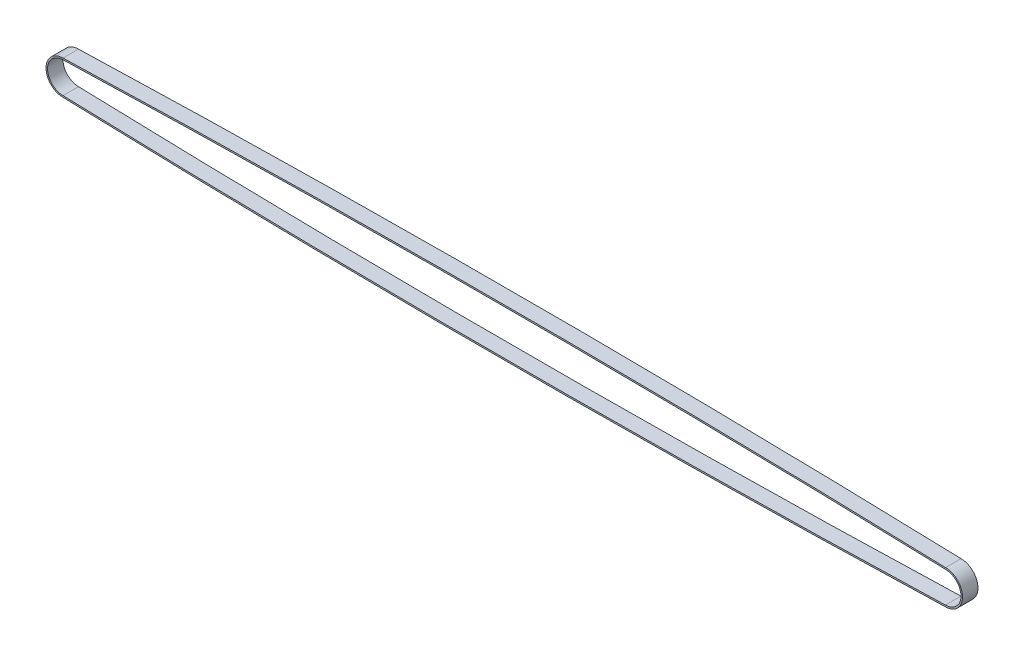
from build123d import *

# Parameters (mm, degrees)
BOSS_EXTRUDE1_DEPTH = 25.4


with BuildPart() as part:
    # Sketch1 → Boss-Extrude1 (new body)
    with BuildSketch(Plane.XY):
        with BuildLine():
            ThreePointArc((-0.041183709, 2.539969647), (723.9, 14.004624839), (1447.841183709, 2.539969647))
            ThreePointArc((1447.841183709, 2.539969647), (1475.74, -25.4), (1447.841183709, -53.339969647))
            ThreePointArc((1447.841183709, -53.339969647), (723.9, -64.804624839), (-0.041183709, -53.339969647))
            ThreePointArc((-0.041183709, -53.339969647), (-27.94, -25.4), (-0.041183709, 2.539969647))
        make_face()
        with BuildLine():
            ThreePointArc((1447.8, -50.8), (1473.2, -25.4), (1447.8, 0))
            ThreePointArc((1447.8, 0), (723.9, 11.464624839), (0, 0))
            ThreePointArc((0, 0), (-25.4, -25.4), (0, -50.8))
            ThreePointArc((0, -50.8), (723.9, -62.264624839), (1447.8, -50.8))
        make_face(mode=Mode.SUBTRACT)
    extrude(amount=BOSS_EXTRUDE1_DEPTH)


solid = part.part
